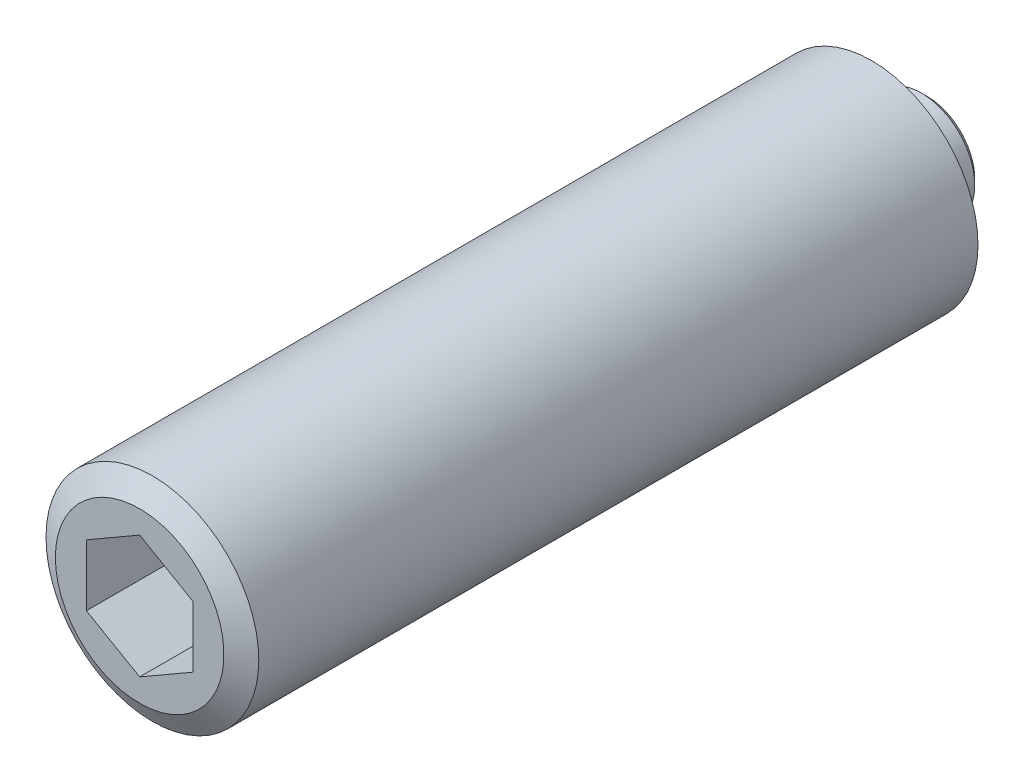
ISO-10303-21;
HEADER;
FILE_DESCRIPTION(('STEP AP214'),'2;1');
FILE_NAME('part.step','',(''),(''),'','','');
FILE_SCHEMA(('AUTOMOTIVE_DESIGN { 1 0 10303 214 1 1 1 1 }'));
ENDSEC;
DATA;
#1=APPLICATION_CONTEXT('core data for automotive mechanical design processes');
#2=APPLICATION_PROTOCOL_DEFINITION('international standard','automotive_design',2000,#1);
#3=PRODUCT_CONTEXT('',#1,'mechanical');
#4=PRODUCT('Part','Part','',(#3));
#5=PRODUCT_RELATED_PRODUCT_CATEGORY('part','',(#4));
#6=PRODUCT_DEFINITION_FORMATION('','',#4);
#7=PRODUCT_DEFINITION_CONTEXT('part definition',#1,'design');
#8=PRODUCT_DEFINITION('design','',#6,#7);
#9=PRODUCT_DEFINITION_SHAPE('','',#8);
#10=(LENGTH_UNIT() NAMED_UNIT(*) SI_UNIT(.MILLI.,.METRE.));
#11=(NAMED_UNIT(*) PLANE_ANGLE_UNIT() SI_UNIT($,.RADIAN.));
#12=(NAMED_UNIT(*) SI_UNIT($,.STERADIAN.) SOLID_ANGLE_UNIT());
#13=UNCERTAINTY_MEASURE_WITH_UNIT(LENGTH_MEASURE(1.E-05),#10,'distance_accuracy_value','');
#14=(GEOMETRIC_REPRESENTATION_CONTEXT(3) GLOBAL_UNCERTAINTY_ASSIGNED_CONTEXT((#13)) GLOBAL_UNIT_ASSIGNED_CONTEXT((#10,
#11,#12)) REPRESENTATION_CONTEXT('',''));
#15=CARTESIAN_POINT('',(0.,0.,0.));
#16=DIRECTION('',(0.,0.,1.));
#17=DIRECTION('',(1.,0.,0.));
#18=AXIS2_PLACEMENT_3D('',#15,#16,#17);
#19=CARTESIAN_POINT('',(0.,0.,0.));
#20=DIRECTION('',(0.,0.,-1.));
#21=DIRECTION('',(-1.,0.,0.));
#22=AXIS2_PLACEMENT_3D('',#19,#20,#21);
#23=PLANE('',#22);
#24=CARTESIAN_POINT('',(0.,0.,0.));
#25=DIRECTION('',(0.,0.,-1.));
#26=DIRECTION('',(-1.,0.,0.));
#27=AXIS2_PLACEMENT_3D('',#24,#25,#26);
#28=CIRCLE('',#27,4.5);
#29=CARTESIAN_POINT('',(-4.5,0.,0.));
#30=VERTEX_POINT('',#29);
#31=EDGE_CURVE('E9',#30,#30,#28,.T.);
#32=ORIENTED_EDGE('',*,*,#31,.T.);
#33=EDGE_LOOP('',(#32));
#34=FACE_BOUND('',#33,.T.);
#35=ADVANCED_FACE('F14',(#34),#23,.T.);
#36=CARTESIAN_POINT('',(0.,0.,0.));
#37=DIRECTION('',(0.,0.,1.));
#38=DIRECTION('',(1.,0.,0.));
#39=AXIS2_PLACEMENT_3D('',#36,#37,#38);
#40=CONICAL_SURFACE('',#39,4.5,0.785398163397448);
#41=CARTESIAN_POINT('',(0.,0.,0.5));
#42=DIRECTION('',(0.,0.,-1.));
#43=DIRECTION('',(-1.,0.,0.));
#44=AXIS2_PLACEMENT_3D('',#41,#42,#43);
#45=CIRCLE('',#44,5.);
#46=CARTESIAN_POINT('',(-5.,0.,0.5));
#47=VERTEX_POINT('',#46);
#48=EDGE_CURVE('E21',#47,#47,#45,.T.);
#49=ORIENTED_EDGE('',*,*,#48,.T.);
#50=EDGE_LOOP('',(#49));
#51=FACE_BOUND('',#50,.T.);
#52=ORIENTED_EDGE('',*,*,#31,.F.);
#53=EDGE_LOOP('',(#52));
#54=FACE_BOUND('',#53,.T.);
#55=ADVANCED_FACE('F143',(#51,#54),#40,.T.);
#56=CARTESIAN_POINT('',(0.,0.,-3.0000000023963));
#57=DIRECTION('',(0.,0.,-1.));
#58=DIRECTION('',(-1.,0.,0.));
#59=AXIS2_PLACEMENT_3D('',#56,#57,#58);
#60=CYLINDRICAL_SURFACE('',#59,5.);
#61=CARTESIAN_POINT('',(0.,0.,2.5));
#62=DIRECTION('',(0.,0.,-1.));
#63=DIRECTION('',(-1.,0.,0.));
#64=AXIS2_PLACEMENT_3D('',#61,#62,#63);
#65=CIRCLE('',#64,5.);
#66=CARTESIAN_POINT('',(-5.,0.,2.5));
#67=VERTEX_POINT('',#66);
#68=EDGE_CURVE('E138',#67,#67,#65,.T.);
#69=ORIENTED_EDGE('',*,*,#68,.T.);
#70=EDGE_LOOP('',(#69));
#71=FACE_BOUND('',#70,.T.);
#72=ORIENTED_EDGE('',*,*,#48,.F.);
#73=EDGE_LOOP('',(#72));
#74=FACE_BOUND('',#73,.T.);
#75=ADVANCED_FACE('F146',(#71,#74),#60,.T.);
#76=CARTESIAN_POINT('',(0.,5.19999997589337,2.5));
#77=DIRECTION('',(0.,0.,-1.));
#78=DIRECTION('',(-1.,0.,0.));
#79=AXIS2_PLACEMENT_3D('',#76,#77,#78);
#80=PLANE('',#79);
#81=CARTESIAN_POINT('',(0.,0.,2.5));
#82=DIRECTION('',(0.,0.,-1.));
#83=DIRECTION('',(-1.,0.,0.));
#84=AXIS2_PLACEMENT_3D('',#81,#82,#83);
#85=CIRCLE('',#84,5.19999997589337);
#86=CARTESIAN_POINT('',(0.,5.1999999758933,2.5));
#87=VERTEX_POINT('',#86);
#88=EDGE_CURVE('E135',#87,#87,#85,.T.);
#89=ORIENTED_EDGE('',*,*,#88,.T.);
#90=EDGE_LOOP('',(#89));
#91=FACE_BOUND('',#90,.T.);
#92=ORIENTED_EDGE('',*,*,#68,.F.);
#93=EDGE_LOOP('',(#92));
#94=FACE_BOUND('',#93,.T.);
#95=ADVANCED_FACE('F148',(#91,#94),#80,.T.);
#96=CARTESIAN_POINT('',(0.,0.,6.4000000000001));
#97=DIRECTION('',(0.,0.,-1.));
#98=DIRECTION('',(0.,1.,0.));
#99=AXIS2_PLACEMENT_3D('',#96,#97,#98);
#100=SPHERICAL_SURFACE('',#99,6.4999999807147);
#101=CARTESIAN_POINT('',(0.,0.,3.99999997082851));
#102=DIRECTION('',(0.,0.,-1.));
#103=DIRECTION('',(-1.,0.,0.));
#104=AXIS2_PLACEMENT_3D('',#101,#102,#103);
#105=CIRCLE('',#104,6.04069529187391);
#106=CARTESIAN_POINT('',(0.,6.0406952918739,3.99999997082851));
#107=VERTEX_POINT('',#106);
#108=EDGE_CURVE('E132',#107,#107,#105,.T.);
#109=CARTESIAN_POINT('',(0.,6.0406952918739,3.99999997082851));
#110=CARTESIAN_POINT('',(0.,6.03406229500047,3.98330500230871));
#111=CARTESIAN_POINT('',(0.,6.02736008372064,3.96663753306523));
#112=CARTESIAN_POINT('',(0.,6.0138177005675,3.9333587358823));
#113=CARTESIAN_POINT('',(0.,6.00697752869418,3.91674740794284));
#114=CARTESIAN_POINT('',(0.,5.99315969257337,3.88358203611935));
#115=CARTESIAN_POINT('',(0.,5.98618202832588,3.86702799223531));
#116=CARTESIAN_POINT('',(0.,5.9720896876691,3.83397832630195));
#117=CARTESIAN_POINT('',(0.,5.96497501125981,3.81748270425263));
#118=CARTESIAN_POINT('',(0.,5.95060913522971,3.78455101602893));
#119=CARTESIAN_POINT('',(0.,5.9433579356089,3.76811494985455));
#120=CARTESIAN_POINT('',(0.,5.9287195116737,3.73530350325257));
#121=CARTESIAN_POINT('',(0.,5.9213322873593,3.71892812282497));
#122=CARTESIAN_POINT('',(0.,5.90642232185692,3.68623917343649));
#123=CARTESIAN_POINT('',(0.,5.89889958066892,3.66992560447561));
#124=CARTESIAN_POINT('',(0.,5.88371909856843,3.63736139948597));
#125=CARTESIAN_POINT('',(0.,5.87606135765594,3.62111076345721));
#126=CARTESIAN_POINT('',(0.,5.86061140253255,3.58867354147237));
#127=CARTESIAN_POINT('',(0.,5.85281918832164,3.57248695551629));
#128=CARTESIAN_POINT('',(0.,5.83710082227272,3.54017894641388));
#129=CARTESIAN_POINT('',(0.,5.82917467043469,3.52405752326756));
#130=CARTESIAN_POINT('',(0.,5.81318897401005,3.49188094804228));
#131=CARTESIAN_POINT('',(0.,5.80512942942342,3.47582579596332));
#132=CARTESIAN_POINT('',(0.,5.78887750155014,3.44378286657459));
#133=CARTESIAN_POINT('',(0.,5.7806851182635,3.42779508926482));
#134=CARTESIAN_POINT('',(0.,5.76416807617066,3.39588800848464));
#135=CARTESIAN_POINT('',(0.,5.75584341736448,3.37996870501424));
#136=CARTESIAN_POINT('',(0.,5.73906239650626,3.34819966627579));
#137=CARTESIAN_POINT('',(0.,5.73060603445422,3.33234993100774));
#138=CARTESIAN_POINT('',(0.,5.71356218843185,3.30072111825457));
#139=CARTESIAN_POINT('',(0.,5.70497470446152,3.28494204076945));
#140=CARTESIAN_POINT('',(0.,5.68766920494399,3.25345562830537));
#141=CARTESIAN_POINT('',(0.,5.6789511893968,3.23774829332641));
#142=CARTESIAN_POINT('',(0.,5.66138522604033,3.20640644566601));
#143=CARTESIAN_POINT('',(0.,5.65253727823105,3.19077193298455));
#144=CARTESIAN_POINT('',(0.,5.63471205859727,3.15957680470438));
#145=CARTESIAN_POINT('',(0.,5.62573478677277,3.14401618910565));
#146=CARTESIAN_POINT('',(0.,5.60765153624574,3.11296992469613));
#147=CARTESIAN_POINT('',(0.,5.5985455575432,3.09748427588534));
#148=CARTESIAN_POINT('',(0.,5.58020551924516,3.06658900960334));
#149=CARTESIAN_POINT('',(0.,5.57097145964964,3.05117939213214));
#150=CARTESIAN_POINT('',(0.,5.55237589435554,3.02043724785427));
#151=CARTESIAN_POINT('',(0.,5.54301438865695,3.00510472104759));
#152=CARTESIAN_POINT('',(0.,5.52416457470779,2.97451781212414));
#153=CARTESIAN_POINT('',(0.,5.51467626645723,2.95926343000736));
#154=CARTESIAN_POINT('',(0.,5.4955734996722,2.9288338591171));
#155=CARTESIAN_POINT('',(0.,5.48595904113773,2.9136586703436));
#156=CARTESIAN_POINT('',(0.,5.46660463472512,2.88338852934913));
#157=CARTESIAN_POINT('',(0.,5.45686468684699,2.86829357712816));
#158=CARTESIAN_POINT('',(0.,5.43725997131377,2.83818494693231));
#159=CARTESIAN_POINT('',(0.,5.42739520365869,2.82317126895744));
#160=CARTESIAN_POINT('',(0.,5.40754152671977,2.79322621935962));
#161=CARTESIAN_POINT('',(0.,5.39755261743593,2.77829484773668));
#162=CARTESIAN_POINT('',(0.,5.37745134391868,2.74851543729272));
#163=CARTESIAN_POINT('',(0.,5.36733897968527,2.7336673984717));
#164=CARTESIAN_POINT('',(0.,5.3469914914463,2.70405567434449));
#165=CARTESIAN_POINT('',(0.,5.33675636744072,2.68929198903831));
#166=CARTESIAN_POINT('',(0.,5.31616406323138,2.65984998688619));
#167=CARTESIAN_POINT('',(0.,5.30580688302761,2.64517167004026));
#168=CARTESIAN_POINT('',(0.,5.28497117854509,2.61590141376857));
#169=CARTESIAN_POINT('',(0.,5.27449265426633,2.60130947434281));
#170=CARTESIAN_POINT('',(0.,5.253414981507,2.57221297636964));
#171=CARTESIAN_POINT('',(0.,5.24281583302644,2.55770841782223));
#172=CARTESIAN_POINT('',(0.,5.22149764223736,2.52878767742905));
#173=CARTESIAN_POINT('',(0.,5.21077859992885,2.51437149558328));
#174=CARTESIAN_POINT('',(0.,5.1999999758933,2.5));
#175=B_SPLINE_CURVE_WITH_KNOTS('',3,(#109,#110,#111,#112,#113,#114,#115,#116,#117,#118,#119,
#120,#121,#122,#123,#124,#125,#126,#127,#128,#129,#130,#131,#132,#133,#134,#135,#136,#137,#138,
#139,#140,#141,#142,#143,#144,#145,#146,#147,#148,#149,#150,#151,#152,#153,#154,#155,#156,#157,
#158,#159,#160,#161,#162,#163,#164,#165,#166,#167,#168,#169,#170,#171,#172,#173,#174),
.UNSPECIFIED.,.F.,.F.,(4,2,2,2,2,2,2,2,2,2,2,2,2,2,2,2,2,2,2,2,2,2,2,2,2,2,2,2,2,2,2,2,4),(0.,
0.0538929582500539,0.107785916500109,0.161678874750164,0.215571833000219,0.269464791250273,
0.323357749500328,0.377250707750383,0.431143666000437,0.485036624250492,0.538929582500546,
0.592822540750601,0.646715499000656,0.700608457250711,0.754501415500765,0.80839437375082,
0.862287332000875,0.916180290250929,0.970073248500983,1.02396620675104,1.07785916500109,
1.13175212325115,1.1856450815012,1.23953803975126,1.29343099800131,1.34732395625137,
1.40121691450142,1.45510987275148,1.50900283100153,1.56289578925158,1.61678874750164,
1.67068170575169,1.72457466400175),.UNSPECIFIED.);
#176=EDGE_CURVE('BSEAM157',#107,#87,#175,.T.);
#177=ORIENTED_EDGE('',*,*,#108,.T.);
#178=ORIENTED_EDGE('',*,*,#88,.F.);
#179=ORIENTED_EDGE('',*,*,#176,.T.);
#180=ORIENTED_EDGE('',*,*,#176,.F.);
#181=EDGE_LOOP('',(#177,#179,#178,#180));
#182=FACE_BOUND('',#181,.T.);
#183=ADVANCED_FACE('F157',(#182),#100,.T.);
#184=CARTESIAN_POINT('',(0.,7.921539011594,3.99999997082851));
#185=DIRECTION('',(0.,0.,-1.));
#186=DIRECTION('',(-1.,0.,0.));
#187=AXIS2_PLACEMENT_3D('',#184,#185,#186);
#188=PLANE('',#187);
#189=CARTESIAN_POINT('',(0.,0.,3.99999997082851));
#190=DIRECTION('',(0.,0.,-1.));
#191=DIRECTION('',(-1.,0.,0.));
#192=AXIS2_PLACEMENT_3D('',#189,#190,#191);
#193=CIRCLE('',#192,7.921539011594);
#194=CARTESIAN_POINT('',(-7.921539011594,0.,3.99999997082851));
#195=VERTEX_POINT('',#194);
#196=EDGE_CURVE('E129',#195,#195,#193,.T.);
#197=ORIENTED_EDGE('',*,*,#196,.T.);
#198=EDGE_LOOP('',(#197));
#199=FACE_BOUND('',#198,.T.);
#200=ORIENTED_EDGE('',*,*,#108,.F.);
#201=EDGE_LOOP('',(#200));
#202=FACE_BOUND('',#201,.T.);
#203=ADVANCED_FACE('F196',(#199,#202),#188,.T.);
#204=CARTESIAN_POINT('',(0.,0.,3.99999997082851));
#205=DIRECTION('',(0.,0.,1.));
#206=DIRECTION('',(1.,0.,0.));
#207=AXIS2_PLACEMENT_3D('',#204,#205,#206);
#208=CONICAL_SURFACE('',#207,7.921539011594,1.0471975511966);
#209=CARTESIAN_POINT('',(0.,0.,5.19999998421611));
#210=DIRECTION('',(0.,0.,-1.));
#211=DIRECTION('',(-1.,0.,0.));
#212=AXIS2_PLACEMENT_3D('',#209,#210,#211);
#213=CIRCLE('',#212,10.0000000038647);
#214=CARTESIAN_POINT('',(-10.0000000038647,0.,5.19999998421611));
#215=VERTEX_POINT('',#214);
#216=EDGE_CURVE('E126',#215,#215,#213,.T.);
#217=ORIENTED_EDGE('',*,*,#216,.T.);
#218=EDGE_LOOP('',(#217));
#219=FACE_BOUND('',#218,.T.);
#220=ORIENTED_EDGE('',*,*,#196,.F.);
#221=EDGE_LOOP('',(#220));
#222=FACE_BOUND('',#221,.T.);
#223=ADVANCED_FACE('F204',(#219,#222),#208,.T.);
#224=CARTESIAN_POINT('',(0.,0.,-3.0000000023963));
#225=DIRECTION('',(0.,0.,-1.));
#226=DIRECTION('',(-1.,0.,0.));
#227=AXIS2_PLACEMENT_3D('',#224,#225,#226);
#228=CYLINDRICAL_SURFACE('',#227,10.0000000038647);
#229=CARTESIAN_POINT('',(0.,0.,72.7999999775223));
#230=DIRECTION('',(0.,0.,-1.));
#231=DIRECTION('',(-1.,0.,0.));
#232=AXIS2_PLACEMENT_3D('',#229,#230,#231);
#233=CIRCLE('',#232,10.0000000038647);
#234=CARTESIAN_POINT('',(-10.0000000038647,0.,72.7999999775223));
#235=VERTEX_POINT('',#234);
#236=EDGE_CURVE('E123',#235,#235,#233,.T.);
#237=ORIENTED_EDGE('',*,*,#236,.T.);
#238=EDGE_LOOP('',(#237));
#239=FACE_BOUND('',#238,.T.);
#240=ORIENTED_EDGE('',*,*,#216,.F.);
#241=EDGE_LOOP('',(#240));
#242=FACE_BOUND('',#241,.T.);
#243=ADVANCED_FACE('F213',(#239,#242),#228,.T.);
#244=CARTESIAN_POINT('',(0.,0.,72.7999999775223));
#245=DIRECTION('',(0.,0.,-1.));
#246=DIRECTION('',(-1.,0.,0.));
#247=AXIS2_PLACEMENT_3D('',#244,#245,#246);
#248=CONICAL_SURFACE('',#247,10.0000000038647,1.0471975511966);
#249=CARTESIAN_POINT('',(0.,0.,73.9999999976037));
#250=DIRECTION('',(0.,0.,-1.));
#251=DIRECTION('',(-1.,0.,0.));
#252=AXIS2_PLACEMENT_3D('',#249,#250,#251);
#253=CIRCLE('',#252,7.921539);
#254=CARTESIAN_POINT('',(-7.921539,0.,73.9999999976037));
#255=VERTEX_POINT('',#254);
#256=EDGE_CURVE('E115',#255,#255,#253,.T.);
#257=ORIENTED_EDGE('',*,*,#256,.T.);
#258=EDGE_LOOP('',(#257));
#259=FACE_BOUND('',#258,.T.);
#260=ORIENTED_EDGE('',*,*,#236,.F.);
#261=EDGE_LOOP('',(#260));
#262=FACE_BOUND('',#261,.T.);
#263=ADVANCED_FACE('F222',(#259,#262),#248,.T.);
#264=CARTESIAN_POINT('',(0.,7.921539,73.9999999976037));
#265=DIRECTION('',(0.,0.,1.));
#266=DIRECTION('',(1.,0.,0.));
#267=AXIS2_PLACEMENT_3D('',#264,#265,#266);
#268=PLANE('',#267);
#269=DIRECTION('',(-0.866025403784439,0.5,0.));
#270=VECTOR('',#269,1.);
#271=CARTESIAN_POINT('',(5.,2.88675134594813,73.9999999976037));
#272=LINE('',#271,#270);
#273=CARTESIAN_POINT('',(5.,2.88675134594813,73.9999999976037));
#274=VERTEX_POINT('',#273);
#275=CARTESIAN_POINT('',(0.,5.77350269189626,73.9999999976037));
#276=VERTEX_POINT('',#275);
#277=EDGE_CURVE('E28',#274,#276,#272,.T.);
#278=ORIENTED_EDGE('',*,*,#277,.F.);
#279=DIRECTION('',(0.,1.,0.));
#280=VECTOR('',#279,1.);
#281=CARTESIAN_POINT('',(5.,-2.88675134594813,73.9999999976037));
#282=LINE('',#281,#280);
#283=CARTESIAN_POINT('',(5.,-2.88675134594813,73.9999999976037));
#284=VERTEX_POINT('',#283);
#285=EDGE_CURVE('E111',#284,#274,#282,.T.);
#286=ORIENTED_EDGE('',*,*,#285,.F.);
#287=DIRECTION('',(0.866025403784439,0.5,0.));
#288=VECTOR('',#287,1.);
#289=CARTESIAN_POINT('',(0.,-5.77350269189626,73.9999999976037));
#290=LINE('',#289,#288);
#291=CARTESIAN_POINT('',(0.,-5.77350269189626,73.9999999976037));
#292=VERTEX_POINT('',#291);
#293=EDGE_CURVE('E109',#292,#284,#290,.T.);
#294=ORIENTED_EDGE('',*,*,#293,.F.);
#295=DIRECTION('',(0.866025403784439,-0.5,0.));
#296=VECTOR('',#295,1.);
#297=CARTESIAN_POINT('',(-5.,-2.88675134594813,73.9999999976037));
#298=LINE('',#297,#296);
#299=CARTESIAN_POINT('',(-5.,-2.88675134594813,73.9999999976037));
#300=VERTEX_POINT('',#299);
#301=EDGE_CURVE('E76',#300,#292,#298,.T.);
#302=ORIENTED_EDGE('',*,*,#301,.F.);
#303=DIRECTION('',(0.,-1.,0.));
#304=VECTOR('',#303,1.);
#305=CARTESIAN_POINT('',(-5.,2.88675134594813,73.9999999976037));
#306=LINE('',#305,#304);
#307=CARTESIAN_POINT('',(-5.,2.88675134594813,73.9999999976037));
#308=VERTEX_POINT('',#307);
#309=EDGE_CURVE('E105',#308,#300,#306,.T.);
#310=ORIENTED_EDGE('',*,*,#309,.F.);
#311=DIRECTION('',(-0.866025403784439,-0.5,0.));
#312=VECTOR('',#311,1.);
#313=CARTESIAN_POINT('',(0.,5.77350269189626,73.9999999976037));
#314=LINE('',#313,#312);
#315=EDGE_CURVE('E102',#276,#308,#314,.T.);
#316=ORIENTED_EDGE('',*,*,#315,.F.);
#317=EDGE_LOOP('',(#278,#286,#294,#302,#310,#316));
#318=FACE_BOUND('',#317,.T.);
#319=ORIENTED_EDGE('',*,*,#256,.F.);
#320=EDGE_LOOP('',(#319));
#321=FACE_BOUND('',#320,.T.);
#322=ADVANCED_FACE('F231',(#318,#321),#268,.T.);
#323=CARTESIAN_POINT('',(5.,2.88675134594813,65.9999999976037));
#324=DIRECTION('',(0.5,0.866025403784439,0.));
#325=DIRECTION('',(-0.866025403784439,0.5,0.));
#326=AXIS2_PLACEMENT_3D('',#323,#324,#325);
#327=PLANE('',#326);
#328=ORIENTED_EDGE('',*,*,#277,.T.);
#329=DIRECTION('',(0.,0.,1.));
#330=VECTOR('',#329,1.);
#331=CARTESIAN_POINT('',(0.,5.77350269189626,65.9999999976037));
#332=LINE('',#331,#330);
#333=CARTESIAN_POINT('',(0.,5.77350269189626,65.9999999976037));
#334=VERTEX_POINT('',#333);
#335=EDGE_CURVE('E58',#334,#276,#332,.T.);
#336=ORIENTED_EDGE('',*,*,#335,.F.);
#337=DIRECTION('',(-0.866025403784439,0.5,0.));
#338=VECTOR('',#337,1.);
#339=CARTESIAN_POINT('',(5.,2.88675134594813,65.9999999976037));
#340=LINE('',#339,#338);
#341=CARTESIAN_POINT('',(5.,2.88675134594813,65.9999999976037));
#342=VERTEX_POINT('',#341);
#343=EDGE_CURVE('E113',#342,#334,#340,.T.);
#344=ORIENTED_EDGE('',*,*,#343,.F.);
#345=DIRECTION('',(0.,0.,1.));
#346=VECTOR('',#345,1.);
#347=CARTESIAN_POINT('',(5.,2.88675134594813,65.9999999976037));
#348=LINE('',#347,#346);
#349=EDGE_CURVE('E36',#342,#274,#348,.T.);
#350=ORIENTED_EDGE('',*,*,#349,.T.);
#351=EDGE_LOOP('',(#328,#336,#344,#350));
#352=FACE_BOUND('',#351,.T.);
#353=ADVANCED_FACE('F240',(#352),#327,.F.);
#354=CARTESIAN_POINT('',(5.,-2.88675134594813,65.9999999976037));
#355=DIRECTION('',(1.,0.,0.));
#356=DIRECTION('',(0.,0.,-1.));
#357=AXIS2_PLACEMENT_3D('',#354,#355,#356);
#358=PLANE('',#357);
#359=ORIENTED_EDGE('',*,*,#285,.T.);
#360=ORIENTED_EDGE('',*,*,#349,.F.);
#361=DIRECTION('',(0.,1.,0.));
#362=VECTOR('',#361,1.);
#363=CARTESIAN_POINT('',(5.,-2.88675134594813,65.9999999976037));
#364=LINE('',#363,#362);
#365=CARTESIAN_POINT('',(5.,-2.88675134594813,65.9999999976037));
#366=VERTEX_POINT('',#365);
#367=EDGE_CURVE('E88',#366,#342,#364,.T.);
#368=ORIENTED_EDGE('',*,*,#367,.F.);
#369=DIRECTION('',(0.,0.,1.));
#370=VECTOR('',#369,1.);
#371=CARTESIAN_POINT('',(5.,-2.88675134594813,65.9999999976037));
#372=LINE('',#371,#370);
#373=EDGE_CURVE('E80',#366,#284,#372,.T.);
#374=ORIENTED_EDGE('',*,*,#373,.T.);
#375=EDGE_LOOP('',(#359,#360,#368,#374));
#376=FACE_BOUND('',#375,.T.);
#377=ADVANCED_FACE('F249',(#376),#358,.F.);
#378=CARTESIAN_POINT('',(0.,-5.77350269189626,65.9999999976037));
#379=DIRECTION('',(0.5,-0.866025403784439,0.));
#380=DIRECTION('',(0.866025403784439,0.5,0.));
#381=AXIS2_PLACEMENT_3D('',#378,#379,#380);
#382=PLANE('',#381);
#383=ORIENTED_EDGE('',*,*,#293,.T.);
#384=ORIENTED_EDGE('',*,*,#373,.F.);
#385=DIRECTION('',(0.866025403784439,0.5,0.));
#386=VECTOR('',#385,1.);
#387=CARTESIAN_POINT('',(0.,-5.77350269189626,65.9999999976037));
#388=LINE('',#387,#386);
#389=CARTESIAN_POINT('',(0.,-5.77350269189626,65.9999999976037));
#390=VERTEX_POINT('',#389);
#391=EDGE_CURVE('E84',#390,#366,#388,.T.);
#392=ORIENTED_EDGE('',*,*,#391,.F.);
#393=DIRECTION('',(0.,0.,1.));
#394=VECTOR('',#393,1.);
#395=CARTESIAN_POINT('',(0.,-5.77350269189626,65.9999999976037));
#396=LINE('',#395,#394);
#397=EDGE_CURVE('E69',#390,#292,#396,.T.);
#398=ORIENTED_EDGE('',*,*,#397,.T.);
#399=EDGE_LOOP('',(#383,#384,#392,#398));
#400=FACE_BOUND('',#399,.T.);
#401=ADVANCED_FACE('F85',(#400),#382,.F.);
#402=CARTESIAN_POINT('',(-5.,-2.88675134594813,65.9999999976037));
#403=DIRECTION('',(-0.5,-0.866025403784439,0.));
#404=DIRECTION('',(0.866025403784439,-0.5,0.));
#405=AXIS2_PLACEMENT_3D('',#402,#403,#404);
#406=PLANE('',#405);
#407=ORIENTED_EDGE('',*,*,#301,.T.);
#408=ORIENTED_EDGE('',*,*,#397,.F.);
#409=DIRECTION('',(0.866025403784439,-0.5,0.));
#410=VECTOR('',#409,1.);
#411=CARTESIAN_POINT('',(-5.,-2.88675134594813,65.9999999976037));
#412=LINE('',#411,#410);
#413=CARTESIAN_POINT('',(-5.,-2.88675134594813,65.9999999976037));
#414=VERTEX_POINT('',#413);
#415=EDGE_CURVE('E73',#414,#390,#412,.T.);
#416=ORIENTED_EDGE('',*,*,#415,.F.);
#417=DIRECTION('',(0.,0.,1.));
#418=VECTOR('',#417,1.);
#419=CARTESIAN_POINT('',(-5.,-2.88675134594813,65.9999999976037));
#420=LINE('',#419,#418);
#421=EDGE_CURVE('E81',#414,#300,#420,.T.);
#422=ORIENTED_EDGE('',*,*,#421,.T.);
#423=EDGE_LOOP('',(#407,#408,#416,#422));
#424=FACE_BOUND('',#423,.T.);
#425=ADVANCED_FACE('F71',(#424),#406,.F.);
#426=CARTESIAN_POINT('',(-5.,2.88675134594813,65.9999999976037));
#427=DIRECTION('',(-1.,0.,0.));
#428=DIRECTION('',(0.,0.,1.));
#429=AXIS2_PLACEMENT_3D('',#426,#427,#428);
#430=PLANE('',#429);
#431=ORIENTED_EDGE('',*,*,#309,.T.);
#432=ORIENTED_EDGE('',*,*,#421,.F.);
#433=DIRECTION('',(0.,-1.,0.));
#434=VECTOR('',#433,1.);
#435=CARTESIAN_POINT('',(-5.,2.88675134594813,65.9999999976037));
#436=LINE('',#435,#434);
#437=CARTESIAN_POINT('',(-5.,2.88675134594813,65.9999999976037));
#438=VERTEX_POINT('',#437);
#439=EDGE_CURVE('E94',#438,#414,#436,.T.);
#440=ORIENTED_EDGE('',*,*,#439,.F.);
#441=DIRECTION('',(0.,0.,1.));
#442=VECTOR('',#441,1.);
#443=CARTESIAN_POINT('',(-5.,2.88675134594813,65.9999999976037));
#444=LINE('',#443,#442);
#445=EDGE_CURVE('E118',#438,#308,#444,.T.);
#446=ORIENTED_EDGE('',*,*,#445,.T.);
#447=EDGE_LOOP('',(#431,#432,#440,#446));
#448=FACE_BOUND('',#447,.T.);
#449=ADVANCED_FACE('F271',(#448),#430,.F.);
#450=CARTESIAN_POINT('',(0.,5.77350269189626,65.9999999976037));
#451=DIRECTION('',(-0.5,0.866025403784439,0.));
#452=DIRECTION('',(-0.866025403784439,-0.5,0.));
#453=AXIS2_PLACEMENT_3D('',#450,#451,#452);
#454=PLANE('',#453);
#455=ORIENTED_EDGE('',*,*,#315,.T.);
#456=ORIENTED_EDGE('',*,*,#445,.F.);
#457=DIRECTION('',(-0.866025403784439,-0.5,0.));
#458=VECTOR('',#457,1.);
#459=CARTESIAN_POINT('',(0.,5.77350269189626,65.9999999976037));
#460=LINE('',#459,#458);
#461=EDGE_CURVE('E96',#334,#438,#460,.T.);
#462=ORIENTED_EDGE('',*,*,#461,.F.);
#463=ORIENTED_EDGE('',*,*,#335,.T.);
#464=EDGE_LOOP('',(#455,#456,#462,#463));
#465=FACE_BOUND('',#464,.T.);
#466=ADVANCED_FACE('F279',(#465),#454,.F.);
#467=CARTESIAN_POINT('',(0.,5.77350269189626,65.9999999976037));
#468=DIRECTION('',(0.,0.,1.));
#469=DIRECTION('',(1.,0.,0.));
#470=AXIS2_PLACEMENT_3D('',#467,#468,#469);
#471=PLANE('',#470);
#472=ORIENTED_EDGE('',*,*,#343,.T.);
#473=ORIENTED_EDGE('',*,*,#461,.T.);
#474=ORIENTED_EDGE('',*,*,#439,.T.);
#475=ORIENTED_EDGE('',*,*,#415,.T.);
#476=ORIENTED_EDGE('',*,*,#391,.T.);
#477=ORIENTED_EDGE('',*,*,#367,.T.);
#478=EDGE_LOOP('',(#472,#473,#474,#475,#476,#477));
#479=FACE_BOUND('',#478,.T.);
#480=ADVANCED_FACE('F91',(#479),#471,.T.);
#481=CLOSED_SHELL('',(#35,#55,#75,#95,#183,#203,#223,#243,#263,#322,#353,#377,#401,#425,#449,
#466,#480));
#482=MANIFOLD_SOLID_BREP('B1',#481);
#483=ADVANCED_BREP_SHAPE_REPRESENTATION('',(#18,#482),#14);
#484=SHAPE_DEFINITION_REPRESENTATION(#9,#483);
ENDSEC;
END-ISO-10303-21;
